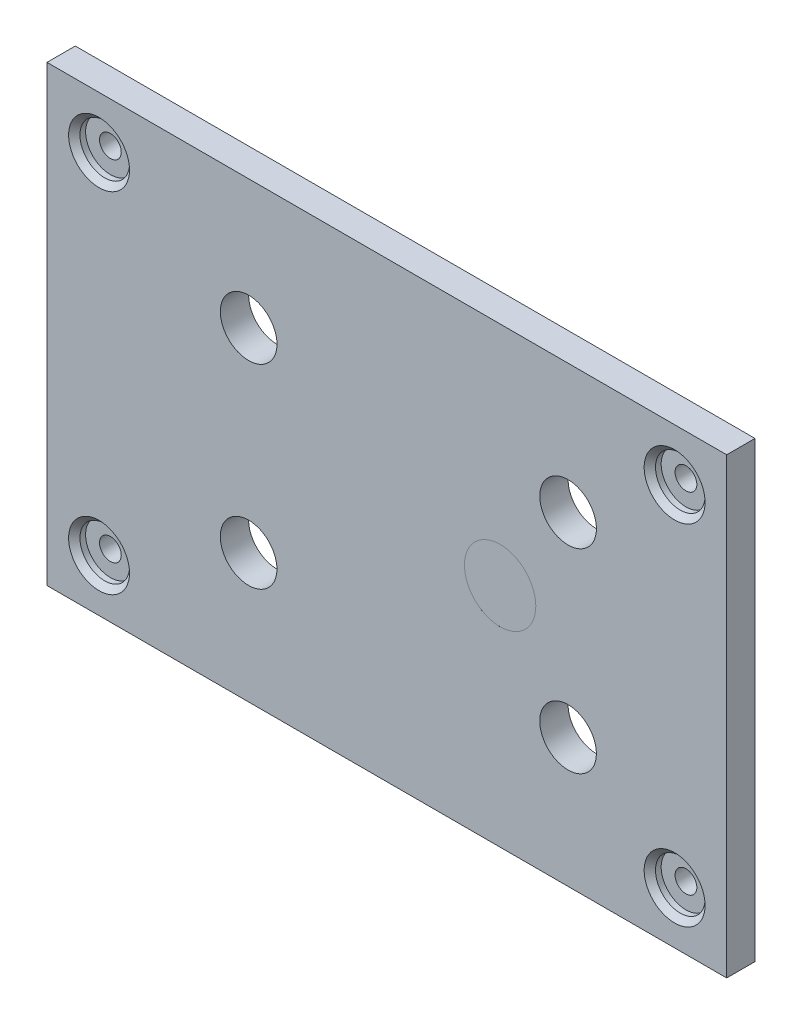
from build123d import *

# Parameters (mm, degrees)
SKETCH1_W                                   = 76.2
SKETCH1_H                                   = 50.8
BOSS_EXTRUDE1_DEPTH                         = 3.175
CBORE_FOR_2_BINDING_HEAD_MACHINE_SC_2_COUNT = 2
CBORE_FOR_2_BINDING_HEAD_MACHINE_SC_2_PITCH = 75.461112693
CBORE_FOR_2_BINDING_HEAD_MACHINE_SC_3_COUNT = 2
CBORE_FOR_2_BINDING_HEAD_MACHINE_SC_3_PITCH = 39.125667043
CBORE_FOR_2_BINDING_HEAD_MACHINE_SC_4_COUNT = 2
CBORE_FOR_2_BINDING_HEAD_MACHINE_SC_4_PITCH = 64.525667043
SKETCH4_R                                   = 4.0005
CUT_EXTRUDE1_DEPTH                          = 0.000254
CBORE_FOR_00_BINDING_HEAD_MACHINE_S_2_COUNT = 2
CBORE_FOR_00_BINDING_HEAD_MACHINE_S_2_PITCH = 41.949235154
CBORE_FOR_00_BINDING_HEAD_MACHINE_S_3_COUNT = 2
CBORE_FOR_00_BINDING_HEAD_MACHINE_S_3_PITCH = 35.814618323
CBORE_FOR_00_BINDING_HEAD_MACHINE_S_4_COUNT = 2
CBORE_FOR_00_BINDING_HEAD_MACHINE_S_4_PITCH = 21.844663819
SKETCH9_R                                   = 3.175
CUT_EXTRUDE2_DEPTH                          = 92.636022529


with BuildPart() as part:
    # Sketch1 → Boss-Extrude1 (new body)
    with BuildSketch(Plane.XY):
        with Locations((38.1, 25.4)):
            Rectangle(SKETCH1_W, SKETCH1_H)
    extrude(amount=BOSS_EXTRUDE1_DEPTH)

    # Sketch3 → CBORE for _2 Binding Head Machine Screw1 (revolve, cut)
    with BuildSketch(Plane(origin=(70.362833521, 5.837166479, 3.175), x_dir=(0, -1, 0), z_dir=(1, 0, 0))):
        Polygon((0, 0), (0, 13.432569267), (1.2192, 12.7), (1.2192, 1.27), (2.77876, 1.27), (2.77876, 0.635), (3.41376, 0), align=None)
    cbore_for_2_binding_head_machine_screw1 = revolve(axis=Axis((70.362833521, 5.837166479, 9.525), (0, 0, -1)), mode=Mode.SUBTRACT)

    # CBORE for _2 Binding Head Machine Sc 2: CBORE for _2 Binding Head Machine Screw1 ×2
    with Locations(*[Vector(-0.8550850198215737, 0.5184878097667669, 0) * (i * CBORE_FOR_2_BINDING_HEAD_MACHINE_SC_2_PITCH) for i in range(1, CBORE_FOR_2_BINDING_HEAD_MACHINE_SC_2_COUNT)]):
        add(cbore_for_2_binding_head_machine_screw1, mode=Mode.SUBTRACT)

    # CBORE for _2 Binding Head Machine Sc 3: CBORE for _2 Binding Head Machine Screw1 ×2
    with Locations(*[(0, i * CBORE_FOR_2_BINDING_HEAD_MACHINE_SC_3_PITCH, 0) for i in range(1, CBORE_FOR_2_BINDING_HEAD_MACHINE_SC_3_COUNT)]):
        add(cbore_for_2_binding_head_machine_screw1, mode=Mode.SUBTRACT)

    # CBORE for _2 Binding Head Machine Sc 4: CBORE for _2 Binding Head Machine Screw1 ×2
    with Locations(*[(-i * CBORE_FOR_2_BINDING_HEAD_MACHINE_SC_4_PITCH, 0, 0) for i in range(1, CBORE_FOR_2_BINDING_HEAD_MACHINE_SC_4_COUNT)]):
        add(cbore_for_2_binding_head_machine_screw1, mode=Mode.SUBTRACT)

    # Sketch4 → Cut-Extrude1 (cut)
    with BuildSketch(Plane.XY.offset(3.175)):
        with Locations((50.8, 25.4)):
            Circle(SKETCH4_R)
    extrude(amount=-CUT_EXTRUDE1_DEPTH, mode=Mode.SUBTRACT)

    # Sketch7 → CBORE for _00 Binding Head Machine Screw (revolve, cut)
    with BuildSketch(Plane(origin=(58.417617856, 14.476338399, 3.175), x_dir=(0, -1, 0), z_dir=(1, 0, 0))):
        Polygon((0, 0), (0, 13.119701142), (0.6985, 12.7), (0.6985, 0.7112), (1.5875, 0.7112), (1.5875, 0.635), (2.2225, 0), align=None)
    cbore_for_00_binding_head_machine_screw = revolve(axis=Axis((58.417617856, 14.476338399, 9.525), (0, 0, -1)), mode=Mode.SUBTRACT)

    # CBORE for _00 Binding Head Machine S 2: CBORE for _00 Binding Head Machine Screw ×2
    with Locations(*[Vector(-0.8536700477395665, 0.5208142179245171, 0) * (i * CBORE_FOR_00_BINDING_HEAD_MACHINE_S_2_PITCH) for i in range(1, CBORE_FOR_00_BINDING_HEAD_MACHINE_S_2_COUNT)]):
        add(cbore_for_00_binding_head_machine_screw, mode=Mode.SUBTRACT)

    # CBORE for _00 Binding Head Machine S 3: CBORE for _00 Binding Head Machine Screw ×2
    with Locations(*[Vector(-0.9999999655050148, 0.00026265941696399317, 0) * (i * CBORE_FOR_00_BINDING_HEAD_MACHINE_S_3_PITCH) for i in range(1, CBORE_FOR_00_BINDING_HEAD_MACHINE_S_3_COUNT)]):
        add(cbore_for_00_binding_head_machine_screw, mode=Mode.SUBTRACT)

    # CBORE for _00 Binding Head Machine S 4: CBORE for _00 Binding Head Machine Screw ×2
    with Locations(*[Vector(0.00017453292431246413, 0.9999999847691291, 0) * (i * CBORE_FOR_00_BINDING_HEAD_MACHINE_S_4_PITCH) for i in range(1, CBORE_FOR_00_BINDING_HEAD_MACHINE_S_4_COUNT)]):
        add(cbore_for_00_binding_head_machine_screw, mode=Mode.SUBTRACT)

    # Sketch9 → Cut-Extrude2 (cut, through all)
    with BuildSketch(Plane.XY.offset(3.175)):
        with Locations((22.606812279, 36.324096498)):
            Circle(SKETCH9_R)
        with Locations((58.421430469, 36.321001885)):
            Circle(SKETCH9_R)
        with Locations((22.603000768, 14.485745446)):
            Circle(SKETCH9_R)
        with Locations((58.417617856, 14.476338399)):
            Circle(SKETCH9_R)
    extrude(amount=-CUT_EXTRUDE2_DEPTH, mode=Mode.SUBTRACT)


solid = part.part
